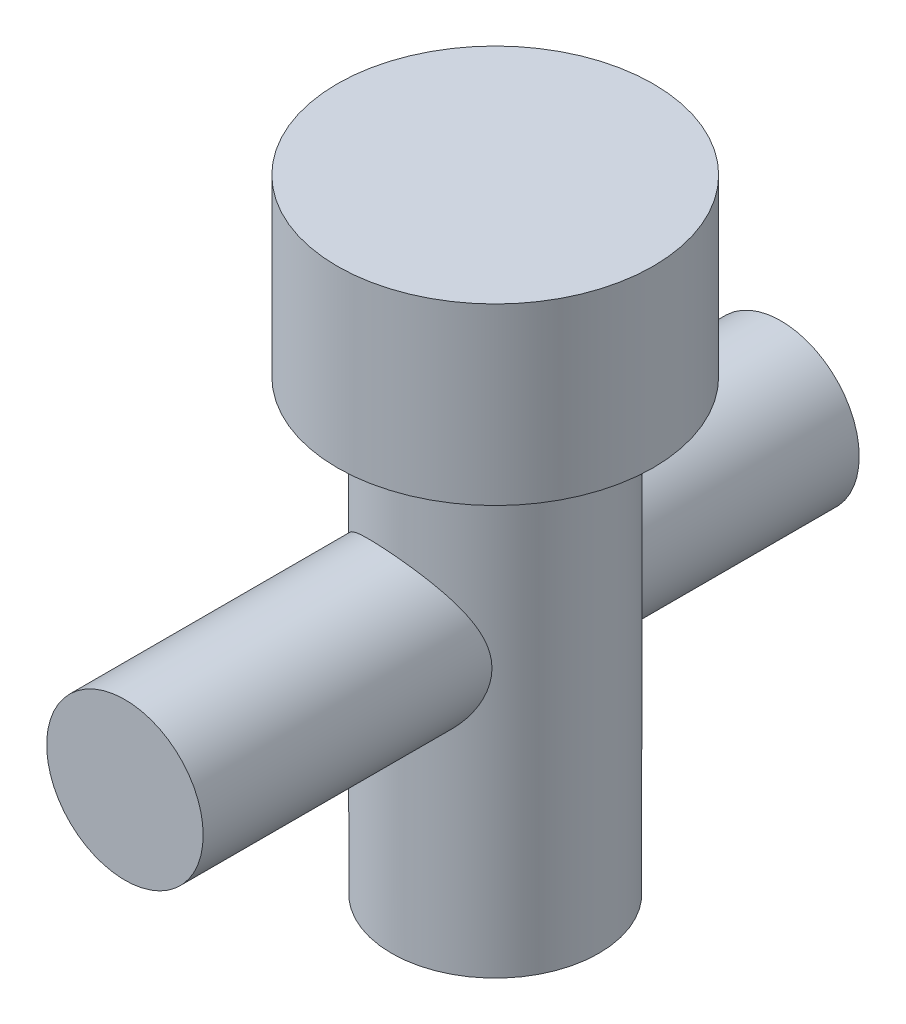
ISO-10303-21;
HEADER;
FILE_DESCRIPTION(('STEP AP214'),'2;1');
FILE_NAME('part.step','',(''),(''),'','','');
FILE_SCHEMA(('AUTOMOTIVE_DESIGN { 1 0 10303 214 1 1 1 1 }'));
ENDSEC;
DATA;
#1=APPLICATION_CONTEXT('core data for automotive mechanical design processes');
#2=APPLICATION_PROTOCOL_DEFINITION('international standard','automotive_design',2000,#1);
#3=PRODUCT_CONTEXT('',#1,'mechanical');
#4=PRODUCT('Part','Part','',(#3));
#5=PRODUCT_RELATED_PRODUCT_CATEGORY('part','',(#4));
#6=PRODUCT_DEFINITION_FORMATION('','',#4);
#7=PRODUCT_DEFINITION_CONTEXT('part definition',#1,'design');
#8=PRODUCT_DEFINITION('design','',#6,#7);
#9=PRODUCT_DEFINITION_SHAPE('','',#8);
#10=(LENGTH_UNIT() NAMED_UNIT(*) SI_UNIT(.MILLI.,.METRE.));
#11=(NAMED_UNIT(*) PLANE_ANGLE_UNIT() SI_UNIT($,.RADIAN.));
#12=(NAMED_UNIT(*) SI_UNIT($,.STERADIAN.) SOLID_ANGLE_UNIT());
#13=UNCERTAINTY_MEASURE_WITH_UNIT(LENGTH_MEASURE(1.E-05),#10,'distance_accuracy_value','');
#14=(GEOMETRIC_REPRESENTATION_CONTEXT(3) GLOBAL_UNCERTAINTY_ASSIGNED_CONTEXT((#13)) GLOBAL_UNIT_ASSIGNED_CONTEXT((#10,
#11,#12)) REPRESENTATION_CONTEXT('',''));
#15=CARTESIAN_POINT('',(0.,0.,0.));
#16=DIRECTION('',(0.,0.,1.));
#17=DIRECTION('',(1.,0.,0.));
#18=AXIS2_PLACEMENT_3D('',#15,#16,#17);
#19=CARTESIAN_POINT('',(-4.3439692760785,14.8945899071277,35.9973134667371));
#20=DIRECTION('',(0.,1.,0.));
#21=DIRECTION('',(0.,0.,1.));
#22=AXIS2_PLACEMENT_3D('',#19,#20,#21);
#23=CYLINDRICAL_SURFACE('',#22,19.4598757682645);
#24=CARTESIAN_POINT('',(-4.3439692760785,14.8945899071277,35.9973134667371));
#25=DIRECTION('',(0.,1.,0.));
#26=DIRECTION('',(0.,0.,1.));
#27=AXIS2_PLACEMENT_3D('',#24,#25,#26);
#28=CIRCLE('',#27,19.4598757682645);
#29=CARTESIAN_POINT('',(-4.3439692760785,14.8945899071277,55.4571892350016));
#30=VERTEX_POINT('',#29);
#31=EDGE_CURVE('E10',#30,#30,#28,.T.);
#32=ORIENTED_EDGE('',*,*,#31,.T.);
#33=EDGE_LOOP('',(#32));
#34=FACE_BOUND('',#33,.T.);
#35=CARTESIAN_POINT('',(-4.3439692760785,36.3945899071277,35.9973134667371));
#36=DIRECTION('',(0.,1.,0.));
#37=DIRECTION('',(0.,0.,1.));
#38=AXIS2_PLACEMENT_3D('',#35,#36,#37);
#39=CIRCLE('',#38,19.4598757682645);
#40=CARTESIAN_POINT('',(-4.3439692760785,36.3945899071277,55.4571892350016));
#41=VERTEX_POINT('',#40);
#42=EDGE_CURVE('E45',#41,#41,#39,.T.);
#43=ORIENTED_EDGE('',*,*,#42,.F.);
#44=EDGE_LOOP('',(#43));
#45=FACE_BOUND('',#44,.T.);
#46=ADVANCED_FACE('F33',(#34,#45),#23,.T.);
#47=CARTESIAN_POINT('',(-4.3439692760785,14.8945899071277,35.9973134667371));
#48=DIRECTION('',(0.,1.,0.));
#49=DIRECTION('',(0.,0.,1.));
#50=AXIS2_PLACEMENT_3D('',#47,#48,#49);
#51=PLANE('',#50);
#52=CARTESIAN_POINT('',(-4.3439692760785,14.8945899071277,35.9973134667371));
#53=DIRECTION('',(0.,1.,0.));
#54=DIRECTION('',(0.,0.,1.));
#55=AXIS2_PLACEMENT_3D('',#52,#53,#54);
#56=CIRCLE('',#55,12.7738991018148);
#57=CARTESIAN_POINT('',(-4.3439692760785,14.8945899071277,48.7712125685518));
#58=VERTEX_POINT('',#57);
#59=EDGE_CURVE('E100',#58,#58,#56,.T.);
#60=ORIENTED_EDGE('',*,*,#59,.T.);
#61=EDGE_LOOP('',(#60));
#62=FACE_BOUND('',#61,.T.);
#63=ORIENTED_EDGE('',*,*,#31,.F.);
#64=EDGE_LOOP('',(#63));
#65=FACE_BOUND('',#64,.T.);
#66=ADVANCED_FACE('F80',(#62,#65),#51,.F.);
#67=CARTESIAN_POINT('',(-4.3439692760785,-54.1054100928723,35.9973134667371));
#68=DIRECTION('',(0.,1.,0.));
#69=DIRECTION('',(0.,0.,1.));
#70=AXIS2_PLACEMENT_3D('',#67,#68,#69);
#71=CYLINDRICAL_SURFACE('',#70,12.7738991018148);
#72=CARTESIAN_POINT('',(-4.3439692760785,-16.8025949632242,48.7712125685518));
#73=CARTESIAN_POINT('',(-4.10546095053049,-16.782512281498,48.7712128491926));
#74=CARTESIAN_POINT('',(-3.86770697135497,-16.7535327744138,48.7645188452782));
#75=CARTESIAN_POINT('',(-3.39562501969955,-16.6780952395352,48.7381556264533));
#76=CARTESIAN_POINT('',(-3.16129854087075,-16.6316298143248,48.7184809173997));
#77=CARTESIAN_POINT('',(-2.69769875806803,-16.5217486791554,48.6668349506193));
#78=CARTESIAN_POINT('',(-2.46843313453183,-16.458308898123,48.6348462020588));
#79=CARTESIAN_POINT('',(-2.0168140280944,-16.3152935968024,48.5595302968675));
#80=CARTESIAN_POINT('',(-1.79446369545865,-16.2357108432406,48.5161980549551));
#81=CARTESIAN_POINT('',(-1.35961531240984,-16.0619660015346,48.4196877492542));
#82=CARTESIAN_POINT('',(-1.14705976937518,-15.9679085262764,48.3665798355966));
#83=CARTESIAN_POINT('',(-0.731154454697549,-15.7657723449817,48.2515652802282));
#84=CARTESIAN_POINT('',(-0.527808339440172,-15.657688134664,48.1896551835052));
#85=CARTESIAN_POINT('',(0.066821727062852,-15.3140167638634,47.9927883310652));
#86=CARTESIAN_POINT('',(0.443226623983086,-15.0587965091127,47.8465722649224));
#87=CARTESIAN_POINT('',(1.18829613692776,-14.474237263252,47.5189836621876));
#88=CARTESIAN_POINT('',(1.55215740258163,-14.1399684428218,47.3355404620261));
#89=CARTESIAN_POINT('',(2.0554228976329,-13.6018509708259,47.0543231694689));
#90=CARTESIAN_POINT('',(2.21628608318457,-13.416072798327,46.9594378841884));
#91=CARTESIAN_POINT('',(2.52336863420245,-13.0327897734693,46.7697176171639));
#92=CARTESIAN_POINT('',(2.66959194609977,-12.8352881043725,46.6748826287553));
#93=CARTESIAN_POINT('',(2.9701892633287,-12.394967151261,46.4717471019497));
#94=CARTESIAN_POINT('',(3.12183556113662,-12.1500934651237,46.3638475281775));
#95=CARTESIAN_POINT('',(3.40372758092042,-11.645399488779,46.1548959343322));
#96=CARTESIAN_POINT('',(3.5339673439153,-11.3855750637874,46.0538458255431));
#97=CARTESIAN_POINT('',(3.77140141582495,-10.8523989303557,45.8632336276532));
#98=CARTESIAN_POINT('',(3.87865457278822,-10.5790840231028,45.7736424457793));
#99=CARTESIAN_POINT('',(4.06881490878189,-10.0195506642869,45.610496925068));
#100=CARTESIAN_POINT('',(4.15173909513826,-9.7333413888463,45.5369313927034));
#101=CARTESIAN_POINT('',(4.26787338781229,-9.24830318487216,45.4319598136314));
#102=CARTESIAN_POINT('',(4.3084230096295,-9.05247163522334,45.3946965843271));
#103=CARTESIAN_POINT('',(4.37744267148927,-8.65701845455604,45.3306783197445));
#104=CARTESIAN_POINT('',(4.40591630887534,-8.45739797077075,45.3039201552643));
#105=CARTESIAN_POINT('',(4.45030952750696,-8.05581839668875,45.2619826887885));
#106=CARTESIAN_POINT('',(4.46624568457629,-7.85386275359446,45.2467880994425));
#107=CARTESIAN_POINT('',(4.48534452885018,-7.44878632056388,45.2285590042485));
#108=CARTESIAN_POINT('',(4.4885068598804,-7.24566549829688,45.2255248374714));
#109=CARTESIAN_POINT('',(4.48199457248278,-6.83966150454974,45.231753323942));
#110=CARTESIAN_POINT('',(4.47230984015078,-6.63677864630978,45.2410256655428));
#111=CARTESIAN_POINT('',(4.44026509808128,-6.23293368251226,45.2714823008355));
#112=CARTESIAN_POINT('',(4.41790518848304,-6.03197156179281,45.2926665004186));
#113=CARTESIAN_POINT('',(4.36085617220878,-5.63307467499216,45.3461119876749));
#114=CARTESIAN_POINT('',(4.32615282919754,-5.43514368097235,45.3783860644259));
#115=CARTESIAN_POINT('',(4.24491519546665,-5.04352888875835,45.4528192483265));
#116=CARTESIAN_POINT('',(4.19837404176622,-4.84984762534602,45.4949840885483));
#117=CARTESIAN_POINT('',(4.07838500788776,-4.41033071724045,45.6017229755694));
#118=CARTESIAN_POINT('',(4.00105352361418,-4.16626159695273,45.6692257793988));
#119=CARTESIAN_POINT('',(3.82855723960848,-3.68795192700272,45.8154128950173));
#120=CARTESIAN_POINT('',(3.73338555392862,-3.45371521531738,45.8941015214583));
#121=CARTESIAN_POINT('',(3.52612301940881,-2.99549905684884,46.0597068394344));
#122=CARTESIAN_POINT('',(3.41400962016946,-2.77153380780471,46.1466344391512));
#123=CARTESIAN_POINT('',(3.17379346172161,-2.33464406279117,46.3258271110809));
#124=CARTESIAN_POINT('',(3.04569187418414,-2.12171875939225,46.418091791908));
#125=CARTESIAN_POINT('',(2.77097577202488,-1.7024496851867,46.6076170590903));
#126=CARTESIAN_POINT('',(2.62400206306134,-1.49637143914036,46.7049438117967));
#127=CARTESIAN_POINT('',(2.31441778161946,-1.09649126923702,46.9001516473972));
#128=CARTESIAN_POINT('',(2.15180274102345,-0.902692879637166,46.9980328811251));
#129=CARTESIAN_POINT('',(1.81151248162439,-0.528156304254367,47.1919938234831));
#130=CARTESIAN_POINT('',(1.63384968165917,-0.347407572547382,47.288074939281));
#131=CARTESIAN_POINT('',(1.26373170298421,0.000455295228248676,47.4763943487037));
#132=CARTESIAN_POINT('',(1.07127676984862,0.167569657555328,47.5686327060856));
#133=CARTESIAN_POINT('',(0.680675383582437,0.480289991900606,47.7433432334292));
#134=CARTESIAN_POINT('',(0.483136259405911,0.626513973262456,47.8260653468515));
#135=CARTESIAN_POINT('',(0.0755414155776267,0.904561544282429,47.9843143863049));
#136=CARTESIAN_POINT('',(-0.134509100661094,1.03639105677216,48.0598442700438));
#137=CARTESIAN_POINT('',(-0.566471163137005,1.28458818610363,48.202013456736));
#138=CARTESIAN_POINT('',(-0.788383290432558,1.40095504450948,48.2686523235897));
#139=CARTESIAN_POINT('',(-1.24303102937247,1.61699222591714,48.3913486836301));
#140=CARTESIAN_POINT('',(-1.47576655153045,1.71666268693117,48.447406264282));
#141=CARTESIAN_POINT('',(-1.95264455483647,1.89881430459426,48.5477680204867));
#142=CARTESIAN_POINT('',(-2.19686523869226,1.98114702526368,48.5919715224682));
#143=CARTESIAN_POINT('',(-2.69310213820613,2.12639256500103,48.6665705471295));
#144=CARTESIAN_POINT('',(-2.94511844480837,2.18930515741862,48.6969659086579));
#145=CARTESIAN_POINT('',(-3.45452242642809,2.29469089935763,48.742772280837));
#146=CARTESIAN_POINT('',(-3.7119054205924,2.33718114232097,48.7581958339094));
#147=CARTESIAN_POINT('',(-4.22971354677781,2.40115309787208,48.7733259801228));
#148=CARTESIAN_POINT('',(-4.4901382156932,2.4226379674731,48.7730349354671));
#149=CARTESIAN_POINT('',(-4.97496959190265,2.44288043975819,48.7575922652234));
#150=CARTESIAN_POINT('',(-5.1993345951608,2.44438960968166,48.7445186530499));
#151=CARTESIAN_POINT('',(-5.64660944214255,2.43184448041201,48.7066006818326));
#152=CARTESIAN_POINT('',(-5.86951944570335,2.41779192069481,48.6817576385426));
#153=CARTESIAN_POINT('',(-6.31225584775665,2.37449814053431,48.6206368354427));
#154=CARTESIAN_POINT('',(-6.53208231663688,2.34525726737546,48.5843593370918));
#155=CARTESIAN_POINT('',(-6.96718915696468,2.27216603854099,48.5009245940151));
#156=CARTESIAN_POINT('',(-7.1824693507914,2.22831511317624,48.4537669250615));
#157=CARTESIAN_POINT('',(-7.60419377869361,2.12745697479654,48.3500430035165));
#158=CARTESIAN_POINT('',(-7.81071987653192,2.07064438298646,48.2936190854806));
#159=CARTESIAN_POINT('',(-8.21717390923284,1.94430610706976,48.1717056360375));
#160=CARTESIAN_POINT('',(-8.41709927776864,1.87477554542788,48.1062126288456));
#161=CARTESIAN_POINT('',(-8.80947526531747,1.72384960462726,47.9670705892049));
#162=CARTESIAN_POINT('',(-9.00192592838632,1.64245429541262,47.893421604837));
#163=CARTESIAN_POINT('',(-9.37878139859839,1.4686175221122,47.7388919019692));
#164=CARTESIAN_POINT('',(-9.56318463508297,1.37617391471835,47.6580097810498));
#165=CARTESIAN_POINT('',(-9.99623135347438,1.14163278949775,47.4560329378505));
#166=CARTESIAN_POINT('',(-10.2407694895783,0.994551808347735,47.3318819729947));
#167=CARTESIAN_POINT('',(-10.7123914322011,0.682099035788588,47.0737760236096));
#168=CARTESIAN_POINT('',(-10.9394691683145,0.516720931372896,46.939817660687));
#169=CARTESIAN_POINT('',(-11.3762352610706,0.168896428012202,46.6643902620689));
#170=CARTESIAN_POINT('',(-11.5858839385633,-0.0135870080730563,46.522905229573));
#171=CARTESIAN_POINT('',(-11.9870334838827,-0.394097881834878,46.2353292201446));
#172=CARTESIAN_POINT('',(-12.1785363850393,-0.592123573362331,46.0892387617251));
#173=CARTESIAN_POINT('',(-12.546101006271,-1.00611514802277,45.7929293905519));
#174=CARTESIAN_POINT('',(-12.7218831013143,-1.22230834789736,45.6426814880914));
#175=CARTESIAN_POINT('',(-13.0545171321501,-1.66969037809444,45.3433769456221));
#176=CARTESIAN_POINT('',(-13.2113645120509,-1.90088279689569,45.1943206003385));
#177=CARTESIAN_POINT('',(-13.5054015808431,-2.37792896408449,44.9014491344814));
#178=CARTESIAN_POINT('',(-13.6426237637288,-2.62375750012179,44.7576256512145));
#179=CARTESIAN_POINT('',(-13.8968313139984,-3.13082701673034,44.4796901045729));
#180=CARTESIAN_POINT('',(-14.0138290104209,-3.39205847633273,44.345572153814));
#181=CARTESIAN_POINT('',(-14.1835411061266,-3.82244315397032,44.1437928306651));
#182=CARTESIAN_POINT('',(-14.243215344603,-3.98649592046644,44.071054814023));
#183=CARTESIAN_POINT('',(-14.3543511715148,-4.32042778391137,43.9328415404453));
#184=CARTESIAN_POINT('',(-14.4058112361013,-4.49030795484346,43.8673676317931));
#185=CARTESIAN_POINT('',(-14.4998531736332,-4.83541128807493,43.7456316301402));
#186=CARTESIAN_POINT('',(-14.5424503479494,-5.01062463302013,43.6893536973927));
#187=CARTESIAN_POINT('',(-14.6182077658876,-5.36615842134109,43.5878694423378));
#188=CARTESIAN_POINT('',(-14.6513737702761,-5.54647567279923,43.5426563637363));
#189=CARTESIAN_POINT('',(-14.7035259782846,-5.88483141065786,43.4708505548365));
#190=CARTESIAN_POINT('',(-14.7238743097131,-6.04228674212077,43.4425044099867));
#191=CARTESIAN_POINT('',(-14.7568387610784,-6.35948265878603,43.3963308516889));
#192=CARTESIAN_POINT('',(-14.7694584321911,-6.51922215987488,43.3784986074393));
#193=CARTESIAN_POINT('',(-14.7867072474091,-6.83990899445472,43.3540755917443));
#194=CARTESIAN_POINT('',(-14.7913408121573,-7.00085561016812,43.3474786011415));
#195=CARTESIAN_POINT('',(-14.7925266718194,-7.3228418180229,43.3457927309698));
#196=CARTESIAN_POINT('',(-14.7890787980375,-7.483881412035,43.3507040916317));
#197=CARTESIAN_POINT('',(-14.7741924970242,-7.80451913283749,43.3718037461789));
#198=CARTESIAN_POINT('',(-14.7627701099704,-7.96411950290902,43.3879694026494));
#199=CARTESIAN_POINT('',(-14.7321996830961,-8.28116582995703,43.4308756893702));
#200=CARTESIAN_POINT('',(-14.7130484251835,-8.43861086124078,43.4576207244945));
#201=CARTESIAN_POINT('',(-14.6444625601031,-8.90667756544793,43.5523433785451));
#202=CARTESIAN_POINT('',(-14.5839043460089,-9.21286000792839,43.634795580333));
#203=CARTESIAN_POINT('',(-14.4529221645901,-9.74278123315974,43.8069516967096));
#204=CARTESIAN_POINT('',(-14.3876483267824,-9.96976835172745,43.8910115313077));
#205=CARTESIAN_POINT('',(-14.2425362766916,-10.4137691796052,44.0722351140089));
#206=CARTESIAN_POINT('',(-14.1626898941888,-10.6307772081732,44.1694062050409));
#207=CARTESIAN_POINT('',(-13.989256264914,-11.0553247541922,44.3734049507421));
#208=CARTESIAN_POINT('',(-13.8956291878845,-11.2628344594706,44.4802602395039));
#209=CARTESIAN_POINT('',(-13.6955507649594,-11.6679884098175,44.7003335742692));
#210=CARTESIAN_POINT('',(-13.5891002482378,-11.8656332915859,44.813551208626));
#211=CARTESIAN_POINT('',(-13.3218037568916,-12.3233299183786,45.0868597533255));
#212=CARTESIAN_POINT('',(-13.1554782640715,-12.57916253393,45.248683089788));
#213=CARTESIAN_POINT('',(-12.8001429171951,-13.0731438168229,45.5745691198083));
#214=CARTESIAN_POINT('',(-12.6111246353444,-13.3112858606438,45.7386326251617));
#215=CARTESIAN_POINT('',(-12.2109244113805,-13.7692221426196,46.064590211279));
#216=CARTESIAN_POINT('',(-11.9997660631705,-13.9890354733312,46.2264863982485));
#217=CARTESIAN_POINT('',(-11.555318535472,-14.4095339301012,46.5445204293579));
#218=CARTESIAN_POINT('',(-11.3220371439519,-14.6102257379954,46.7006602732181));
#219=CARTESIAN_POINT('',(-10.8837378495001,-14.9517840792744,46.9725634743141));
#220=CARTESIAN_POINT('',(-10.6827501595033,-15.0964738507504,47.0900350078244));
#221=CARTESIAN_POINT('',(-10.2672192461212,-15.3716514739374,47.3173693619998));
#222=CARTESIAN_POINT('',(-10.0526787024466,-15.5021421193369,47.427233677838));
#223=CARTESIAN_POINT('',(-9.61069612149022,-15.7475233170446,47.6374992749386));
#224=CARTESIAN_POINT('',(-9.38326556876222,-15.8624274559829,47.7379087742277));
#225=CARTESIAN_POINT('',(-8.91614278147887,-16.0752786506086,47.9275787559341));
#226=CARTESIAN_POINT('',(-8.67645283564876,-16.1732288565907,48.0168413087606));
#227=CARTESIAN_POINT('',(-8.2251258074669,-16.3364666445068,48.1692677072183));
#228=CARTESIAN_POINT('',(-8.01510811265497,-16.4044719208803,48.2343236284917));
#229=CARTESIAN_POINT('',(-7.58824647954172,-16.5264707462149,48.3543475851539));
#230=CARTESIAN_POINT('',(-7.37140383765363,-16.580466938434,48.4093175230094));
#231=CARTESIAN_POINT('',(-6.9324243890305,-16.6735250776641,48.5082261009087));
#232=CARTESIAN_POINT('',(-6.71029637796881,-16.7126102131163,48.5521818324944));
#233=CARTESIAN_POINT('',(-6.26195833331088,-16.7752276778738,48.6284457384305));
#234=CARTESIAN_POINT('',(-6.03574977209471,-16.7987655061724,48.6607580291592));
#235=CARTESIAN_POINT('',(-5.56564079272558,-16.8308081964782,48.7150040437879));
#236=CARTESIAN_POINT('',(-5.32156655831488,-16.8382058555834,48.7361019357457));
#237=CARTESIAN_POINT('',(-4.83272157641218,-16.8343721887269,48.7642069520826));
#238=CARTESIAN_POINT('',(-4.58795074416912,-16.823138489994,48.7712122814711));
#239=CARTESIAN_POINT('',(-4.3439692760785,-16.8025949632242,48.7712125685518));
#240=B_SPLINE_CURVE_WITH_KNOTS('',3,(#72,#73,#74,#75,#76,#77,#78,#79,#80,#81,#82,#83,#84,#85,
#86,#87,#88,#89,#90,#91,#92,#93,#94,#95,#96,#97,#98,#99,#100,#101,#102,#103,#104,#105,#106,#107,
#108,#109,#110,#111,#112,#113,#114,#115,#116,#117,#118,#119,#120,#121,#122,#123,#124,#125,#126,
#127,#128,#129,#130,#131,#132,#133,#134,#135,#136,#137,#138,#139,#140,#141,#142,#143,#144,#145,
#146,#147,#148,#149,#150,#151,#152,#153,#154,#155,#156,#157,#158,#159,#160,#161,#162,#163,#164,
#165,#166,#167,#168,#169,#170,#171,#172,#173,#174,#175,#176,#177,#178,#179,#180,#181,#182,#183,
#184,#185,#186,#187,#188,#189,#190,#191,#192,#193,#194,#195,#196,#197,#198,#199,#200,#201,#202,
#203,#204,#205,#206,#207,#208,#209,#210,#211,#212,#213,#214,#215,#216,#217,#218,#219,#220,#221,
#222,#223,#224,#225,#226,#227,#228,#229,#230,#231,#232,#233,#234,#235,#236,#237,#238,#239),
.UNSPECIFIED.,.T.,.F.,(4,2,2,2,2,2,2,2,2,2,2,2,2,2,2,2,2,2,2,2,2,2,2,2,2,2,2,2,2,2,2,2,2,2,2,2,
2,2,2,2,2,2,2,2,2,2,2,2,2,2,2,2,2,2,2,2,2,2,2,2,2,2,2,2,2,2,2,2,2,2,2,2,2,2,2,2,2,2,2,2,2,2,2,
4),(0.,0.717794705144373,1.43589341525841,2.15501589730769,2.87446131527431,3.58893216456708,
4.30368423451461,5.73145529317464,7.3065012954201,8.09624417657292,8.88577359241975,
9.80736478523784,10.7292120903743,11.6486704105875,12.5674844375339,13.1771808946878,
13.7866956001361,14.3954031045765,15.0041275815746,15.613331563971,16.2225307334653,
16.8324348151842,17.4426932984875,18.2358531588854,19.0293197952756,19.8238520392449,
20.6183260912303,21.4311463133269,22.2441994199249,23.0565879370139,23.868962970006,
24.6461601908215,25.423036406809,26.1999507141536,26.9768585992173,27.7601693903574,
28.5434893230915,29.3261524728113,30.1086979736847,30.7821151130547,31.4554569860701,
32.1287834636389,32.8021361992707,33.4659759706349,34.1300708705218,34.794161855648,
35.4583818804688,36.3906396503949,37.3232200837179,38.2578685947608,39.1924122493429,
40.1411905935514,41.0901967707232,42.037612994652,42.9844496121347,43.551463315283,
44.1185820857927,44.6847134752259,45.250498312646,45.7338238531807,46.216927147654,
46.6997629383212,47.1826088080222,47.6644862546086,48.1465645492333,49.1112299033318,
49.8623864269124,50.6139653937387,51.3677609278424,52.1215077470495,53.1563910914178,
54.1916599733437,55.2258366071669,56.2596505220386,57.0812172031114,57.9026219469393,
58.7233060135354,59.543837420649,60.2335610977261,60.9231545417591,61.6116711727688,
62.2999441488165,63.0341168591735,63.7683830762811),.UNSPECIFIED.);
#241=CARTESIAN_POINT('',(-4.3439692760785,-16.8025949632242,48.7712125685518));
#242=VERTEX_POINT('',#241);
#243=EDGE_CURVE('E37',#242,#242,#240,.T.);
#244=ORIENTED_EDGE('',*,*,#243,.F.);
#245=EDGE_LOOP('',(#244));
#246=FACE_BOUND('',#245,.T.);
#247=CARTESIAN_POINT('',(4.486491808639,-7.19734011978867,26.7671750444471));
#248=CARTESIAN_POINT('',(4.48649894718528,-7.43091263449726,26.7671887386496));
#249=CARTESIAN_POINT('',(4.47798868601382,-7.6644267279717,26.7590194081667));
#250=CARTESIAN_POINT('',(4.44416932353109,-8.12921697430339,26.7268395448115));
#251=CARTESIAN_POINT('',(4.41885491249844,-8.36049239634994,26.7028240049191));
#252=CARTESIAN_POINT('',(4.35192864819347,-8.81902882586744,26.6401806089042));
#253=CARTESIAN_POINT('',(4.310289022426,-9.04628229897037,26.6015278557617));
#254=CARTESIAN_POINT('',(4.21149129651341,-9.49489682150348,26.511479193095));
#255=CARTESIAN_POINT('',(4.15432489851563,-9.71625465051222,26.4600764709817));
#256=CARTESIAN_POINT('',(4.02608846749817,-10.1493446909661,26.3473490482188));
#257=CARTESIAN_POINT('',(3.95518572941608,-10.3611582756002,26.2861451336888));
#258=CARTESIAN_POINT('',(3.79989300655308,-10.7770702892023,26.1555491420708));
#259=CARTESIAN_POINT('',(3.71550415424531,-10.981169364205,26.0861577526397));
#260=CARTESIAN_POINT('',(3.44309544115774,-11.5813361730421,25.8687468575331));
#261=CARTESIAN_POINT('',(3.23576006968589,-11.9655170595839,25.7114228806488));
#262=CARTESIAN_POINT('',(2.8693322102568,-12.5476743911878,25.4536688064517));
#263=CARTESIAN_POINT('',(2.72558640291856,-12.7571240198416,25.356520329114));
#264=CARTESIAN_POINT('',(2.42225483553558,-13.1637971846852,25.1611144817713));
#265=CARTESIAN_POINT('',(2.26266784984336,-13.3610197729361,25.0628570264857));
#266=CARTESIAN_POINT('',(1.92792549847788,-13.7428413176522,24.8674682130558));
#267=CARTESIAN_POINT('',(1.75275166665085,-13.9274248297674,24.7703383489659));
#268=CARTESIAN_POINT('',(1.38738791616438,-14.2829997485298,24.579497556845));
#269=CARTESIAN_POINT('',(1.19719850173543,-14.4539916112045,24.4857865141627));
#270=CARTESIAN_POINT('',(0.775067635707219,-14.8039900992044,24.2913703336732));
#271=CARTESIAN_POINT('',(0.540979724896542,-14.9808708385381,24.191472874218));
#272=CARTESIAN_POINT('',(0.0547386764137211,-15.3142336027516,24.0018157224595));
#273=CARTESIAN_POINT('',(-0.197417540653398,-15.4707121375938,23.9120577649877));
#274=CARTESIAN_POINT('',(-0.717965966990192,-15.7610042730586,23.7458195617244));
#275=CARTESIAN_POINT('',(-0.986326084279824,-15.8948607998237,23.6693141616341));
#276=CARTESIAN_POINT('',(-1.53775439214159,-16.1381189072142,23.5322321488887));
#277=CARTESIAN_POINT('',(-1.82081556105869,-16.2475320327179,23.4716480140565));
#278=CARTESIAN_POINT('',(-2.31718531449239,-16.4126746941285,23.3834701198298));
#279=CARTESIAN_POINT('',(-2.52758470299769,-16.4748357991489,23.3513919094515));
#280=CARTESIAN_POINT('',(-2.9533589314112,-16.5848865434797,23.2975218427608));
#281=CARTESIAN_POINT('',(-3.16873269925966,-16.6327792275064,23.2757277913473));
#282=CARTESIAN_POINT('',(-3.60294354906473,-16.7137412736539,23.243068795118));
#283=CARTESIAN_POINT('',(-3.82177859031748,-16.7468190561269,23.2321976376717));
#284=CARTESIAN_POINT('',(-4.26148880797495,-16.7978444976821,23.2217878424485));
#285=CARTESIAN_POINT('',(-4.48236406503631,-16.8157915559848,23.2222496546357));
#286=CARTESIAN_POINT('',(-4.92473260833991,-16.8364344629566,23.2347030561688));
#287=CARTESIAN_POINT('',(-5.1462262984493,-16.8391144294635,23.2467066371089));
#288=CARTESIAN_POINT('',(-5.58794627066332,-16.8292903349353,23.2821998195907));
#289=CARTESIAN_POINT('',(-5.80817256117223,-16.8167863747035,23.3056893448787));
#290=CARTESIAN_POINT('',(-6.24582919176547,-16.7769297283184,23.363858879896));
#291=CARTESIAN_POINT('',(-6.46325884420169,-16.7495734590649,23.3985415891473));
#292=CARTESIAN_POINT('',(-6.89382908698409,-16.6805491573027,23.4785807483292));
#293=CARTESIAN_POINT('',(-7.10696959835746,-16.6388808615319,23.5239373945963));
#294=CARTESIAN_POINT('',(-7.52699135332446,-16.5420895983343,23.6244662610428));
#295=CARTESIAN_POINT('',(-7.73389134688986,-16.4870126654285,23.6796047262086));
#296=CARTESIAN_POINT('',(-8.14123248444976,-16.364091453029,23.7990200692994));
#297=CARTESIAN_POINT('',(-8.34167108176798,-16.2962422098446,23.8633004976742));
#298=CARTESIAN_POINT('',(-8.7351953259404,-16.1486154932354,24.0001042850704));
#299=CARTESIAN_POINT('',(-8.92828084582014,-16.0688378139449,24.0726277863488));
#300=CARTESIAN_POINT('',(-9.30650238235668,-15.8981727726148,24.2250003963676));
#301=CARTESIAN_POINT('',(-9.49163684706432,-15.8072832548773,24.3048509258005));
#302=CARTESIAN_POINT('',(-9.92548332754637,-15.5769629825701,24.5039850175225));
#303=CARTESIAN_POINT('',(-10.1701962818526,-15.432603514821,24.6263209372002));
#304=CARTESIAN_POINT('',(-10.6424289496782,-15.1256370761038,24.8809325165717));
#305=CARTESIAN_POINT('',(-10.8699427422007,-14.9630238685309,25.0132115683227));
#306=CARTESIAN_POINT('',(-11.3077934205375,-14.6208101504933,25.2854398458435));
#307=CARTESIAN_POINT('',(-11.5180934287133,-14.4411748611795,25.4254045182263));
#308=CARTESIAN_POINT('',(-11.9207798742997,-14.0664394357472,25.7101736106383));
#309=CARTESIAN_POINT('',(-12.113168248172,-13.8713409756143,25.8549775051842));
#310=CARTESIAN_POINT('',(-12.4827432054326,-13.4633770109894,26.1489915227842));
#311=CARTESIAN_POINT('',(-12.6596548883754,-13.2502868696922,26.2982351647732));
#312=CARTESIAN_POINT('',(-12.9948102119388,-12.8092853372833,26.5959475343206));
#313=CARTESIAN_POINT('',(-13.1530497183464,-12.581370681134,26.7444160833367));
#314=CARTESIAN_POINT('',(-13.4502117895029,-12.1110480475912,27.0367214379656));
#315=CARTESIAN_POINT('',(-13.5891622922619,-11.8686617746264,27.1805647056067));
#316=CARTESIAN_POINT('',(-13.8472131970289,-11.3687310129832,27.4593480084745));
#317=CARTESIAN_POINT('',(-13.9663246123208,-11.1111950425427,27.5942929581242));
#318=CARTESIAN_POINT('',(-14.1412355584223,-10.6834541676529,27.7999588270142));
#319=CARTESIAN_POINT('',(-14.2036648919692,-10.5181495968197,27.8752783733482));
#320=CARTESIAN_POINT('',(-14.3201642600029,-10.1815254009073,28.0188070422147));
#321=CARTESIAN_POINT('',(-14.374232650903,-10.0102046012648,28.0870147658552));
#322=CARTESIAN_POINT('',(-14.4733374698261,-9.66198607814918,28.214325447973));
#323=CARTESIAN_POINT('',(-14.5183890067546,-9.48509826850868,28.2734435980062));
#324=CARTESIAN_POINT('',(-14.5988841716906,-9.12593994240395,28.3806396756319));
#325=CARTESIAN_POINT('',(-14.6343337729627,-8.94367285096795,28.4287244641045));
#326=CARTESIAN_POINT('',(-14.690231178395,-8.60322922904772,28.505367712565));
#327=CARTESIAN_POINT('',(-14.7121551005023,-8.44571813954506,28.5358004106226));
#328=CARTESIAN_POINT('',(-14.7482752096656,-8.12821298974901,28.5862484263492));
#329=CARTESIAN_POINT('',(-14.7624750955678,-7.96822015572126,28.6062687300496));
#330=CARTESIAN_POINT('',(-14.7828589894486,-7.64681873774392,28.6350858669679));
#331=CARTESIAN_POINT('',(-14.7890485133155,-7.48541120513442,28.6438904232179));
#332=CARTESIAN_POINT('',(-14.7932894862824,-7.16226729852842,28.6499180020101));
#333=CARTESIAN_POINT('',(-14.7913408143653,-7.00053091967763,28.6471408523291));
#334=CARTESIAN_POINT('',(-14.779356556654,-6.67814548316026,28.630136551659));
#335=CARTESIAN_POINT('',(-14.7693296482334,-6.51749544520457,28.6159216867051));
#336=CARTESIAN_POINT('',(-14.7414198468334,-6.19823209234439,28.5766602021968));
#337=CARTESIAN_POINT('',(-14.7235368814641,-6.0396187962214,28.5516134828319));
#338=CARTESIAN_POINT('',(-14.6802344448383,-5.72513346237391,28.4916166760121));
#339=CARTESIAN_POINT('',(-14.6548055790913,-5.56926509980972,28.4566542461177));
#340=CARTESIAN_POINT('',(-14.5968279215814,-5.26107621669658,28.3780108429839));
#341=CARTESIAN_POINT('',(-14.5642769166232,-5.10875681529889,28.3343271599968));
#342=CARTESIAN_POINT('',(-14.473655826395,-4.72927960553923,28.2146308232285));
#343=CARTESIAN_POINT('',(-14.4111515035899,-4.50473007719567,28.1336723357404));
#344=CARTESIAN_POINT('',(-14.271913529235,-4.06538306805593,27.9585991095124));
#345=CARTESIAN_POINT('',(-14.1951721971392,-3.85059092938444,27.864477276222));
#346=CARTESIAN_POINT('',(-14.028266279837,-3.43016263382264,27.6664248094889));
#347=CARTESIAN_POINT('',(-13.9380630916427,-3.22455509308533,27.562466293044));
#348=CARTESIAN_POINT('',(-13.7451520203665,-2.822941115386,27.34797317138));
#349=CARTESIAN_POINT('',(-13.6424448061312,-2.6269341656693,27.237438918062));
#350=CARTESIAN_POINT('',(-13.3820778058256,-2.16866765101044,26.9677682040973));
#351=CARTESIAN_POINT('',(-13.2187256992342,-1.91078322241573,26.8066637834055));
#352=CARTESIAN_POINT('',(-12.8693121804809,-1.41267582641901,26.4816397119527));
#353=CARTESIAN_POINT('',(-12.6832419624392,-1.17245976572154,26.3177189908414));
#354=CARTESIAN_POINT('',(-12.2889105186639,-0.710237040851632,25.9915232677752));
#355=CARTESIAN_POINT('',(-12.0806693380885,-0.488214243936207,25.8292469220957));
#356=CARTESIAN_POINT('',(-11.6420599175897,-0.0631150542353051,25.5099918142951));
#357=CARTESIAN_POINT('',(-11.4116993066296,0.139967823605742,25.3530112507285));
#358=CARTESIAN_POINT('',(-10.9767455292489,0.487554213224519,25.0780053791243));
#359=CARTESIAN_POINT('',(-10.7760512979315,0.63570481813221,24.9584105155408));
#360=CARTESIAN_POINT('',(-10.3608013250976,0.917723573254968,24.7266998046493));
#361=CARTESIAN_POINT('',(-10.1462482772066,1.05159448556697,24.6145825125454));
#362=CARTESIAN_POINT('',(-9.70397996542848,1.30360625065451,24.3997641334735));
#363=CARTESIAN_POINT('',(-9.47628070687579,1.42176567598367,24.297051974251));
#364=CARTESIAN_POINT('',(-9.00826615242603,1.64103163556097,24.1027352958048));
#365=CARTESIAN_POINT('',(-8.76795300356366,1.74214105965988,24.0111288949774));
#366=CARTESIAN_POINT('',(-8.31630867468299,1.91063155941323,23.8548103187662));
#367=CARTESIAN_POINT('',(-8.10669731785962,1.98082474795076,23.7881519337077));
#368=CARTESIAN_POINT('',(-7.68044861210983,2.10723963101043,23.6648522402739));
#369=CARTESIAN_POINT('',(-7.46381262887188,2.16346402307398,23.608208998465));
#370=CARTESIAN_POINT('',(-7.02475205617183,2.26105449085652,23.5058486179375));
#371=CARTESIAN_POINT('',(-6.80232939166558,2.30242544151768,23.4601278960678));
#372=CARTESIAN_POINT('',(-6.35306441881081,2.36957619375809,23.3803376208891));
#373=CARTESIAN_POINT('',(-6.12622205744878,2.39535580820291,23.3462682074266));
#374=CARTESIAN_POINT('',(-5.66891732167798,2.43081741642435,23.2902180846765));
#375=CARTESIAN_POINT('',(-5.43844452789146,2.44043838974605,23.2682834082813));
#376=CARTESIAN_POINT('',(-4.97654733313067,2.4430613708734,23.2369873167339));
#377=CARTESIAN_POINT('',(-4.74512292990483,2.43606333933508,23.227625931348));
#378=CARTESIAN_POINT('',(-4.2832141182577,2.40539551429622,23.2214706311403));
#379=CARTESIAN_POINT('',(-4.05272972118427,2.38172552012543,23.2246768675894));
#380=CARTESIAN_POINT('',(-3.59456229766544,2.31794164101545,23.243355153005));
#381=CARTESIAN_POINT('',(-3.36687919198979,2.27782822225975,23.2588268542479));
#382=CARTESIAN_POINT('',(-2.92955882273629,2.18452639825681,23.3001774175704));
#383=CARTESIAN_POINT('',(-2.71965772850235,2.13226547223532,23.3253771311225));
#384=CARTESIAN_POINT('',(-2.3050518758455,2.01418119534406,23.3854457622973));
#385=CARTESIAN_POINT('',(-2.10034892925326,1.9483531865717,23.4203180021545));
#386=CARTESIAN_POINT('',(-1.69736182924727,1.80383394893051,23.4989093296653));
#387=CARTESIAN_POINT('',(-1.49907597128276,1.72514617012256,23.5426260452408));
#388=CARTESIAN_POINT('',(-1.1096900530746,1.55559112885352,23.6380198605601));
#389=CARTESIAN_POINT('',(-0.918592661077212,1.46471939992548,23.6896998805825));
#390=CARTESIAN_POINT('',(-0.528503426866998,1.26336534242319,23.8047134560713));
#391=CARTESIAN_POINT('',(-0.330214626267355,1.15187378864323,23.868663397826));
#392=CARTESIAN_POINT('',(0.0563685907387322,0.916312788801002,24.0035042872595));
#393=CARTESIAN_POINT('',(0.244658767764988,0.792238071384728,24.0743981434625));
#394=CARTESIAN_POINT('',(0.610721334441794,0.532331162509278,24.2218098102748));
#395=CARTESIAN_POINT('',(0.788489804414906,0.396494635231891,24.2983296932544));
#396=CARTESIAN_POINT('',(1.13307025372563,0.113825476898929,24.4556317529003));
#397=CARTESIAN_POINT('',(1.29988095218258,-0.0330084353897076,24.5364144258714));
#398=CARTESIAN_POINT('',(1.65129011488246,-0.364447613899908,24.715693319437));
#399=CARTESIAN_POINT('',(1.83367928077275,-0.551092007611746,24.814758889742));
#400=CARTESIAN_POINT('',(2.18236594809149,-0.938033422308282,25.014607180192));
#401=CARTESIAN_POINT('',(2.34866083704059,-1.13833265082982,25.1153901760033));
#402=CARTESIAN_POINT('',(2.66479826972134,-1.55209707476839,25.3162662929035));
#403=CARTESIAN_POINT('',(2.81462958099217,-1.7655711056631,25.4163588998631));
#404=CARTESIAN_POINT('',(3.0971301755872,-2.20507627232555,25.6130873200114));
#405=CARTESIAN_POINT('',(3.22980222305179,-2.43110537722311,25.7097236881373));
#406=CARTESIAN_POINT('',(3.46101841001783,-2.86488048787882,25.8843108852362));
#407=CARTESIAN_POINT('',(3.56175647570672,-3.07113983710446,25.9630506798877));
#408=CARTESIAN_POINT('',(3.7490696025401,-3.49251171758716,26.1135059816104));
#409=CARTESIAN_POINT('',(3.83564423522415,-3.70762451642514,26.1852212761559));
#410=CARTESIAN_POINT('',(3.99363789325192,-4.1456778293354,26.3191154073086));
#411=CARTESIAN_POINT('',(4.06509069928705,-4.36859957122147,26.3813154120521));
#412=CARTESIAN_POINT('',(4.19213611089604,-4.82174455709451,26.4939139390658));
#413=CARTESIAN_POINT('',(4.2477347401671,-5.05196499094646,26.5443169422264));
#414=CARTESIAN_POINT('',(4.35789953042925,-5.59636152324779,26.6454477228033));
#415=CARTESIAN_POINT('',(4.40594488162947,-5.91294456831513,26.6906842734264));
#416=CARTESIAN_POINT('',(4.47023149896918,-6.55217009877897,26.7515342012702));
#417=CARTESIAN_POINT('',(4.48648195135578,-6.87481080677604,26.7671561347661));
#418=CARTESIAN_POINT('',(4.486491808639,-7.19734011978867,26.7671750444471));
#419=B_SPLINE_CURVE_WITH_KNOTS('',3,(#247,#248,#249,#250,#251,#252,#253,#254,#255,#256,#257,
#258,#259,#260,#261,#262,#263,#264,#265,#266,#267,#268,#269,#270,#271,#272,#273,#274,#275,#276,
#277,#278,#279,#280,#281,#282,#283,#284,#285,#286,#287,#288,#289,#290,#291,#292,#293,#294,#295,
#296,#297,#298,#299,#300,#301,#302,#303,#304,#305,#306,#307,#308,#309,#310,#311,#312,#313,#314,
#315,#316,#317,#318,#319,#320,#321,#322,#323,#324,#325,#326,#327,#328,#329,#330,#331,#332,#333,
#334,#335,#336,#337,#338,#339,#340,#341,#342,#343,#344,#345,#346,#347,#348,#349,#350,#351,#352,
#353,#354,#355,#356,#357,#358,#359,#360,#361,#362,#363,#364,#365,#366,#367,#368,#369,#370,#371,
#372,#373,#374,#375,#376,#377,#378,#379,#380,#381,#382,#383,#384,#385,#386,#387,#388,#389,#390,
#391,#392,#393,#394,#395,#396,#397,#398,#399,#400,#401,#402,#403,#404,#405,#406,#407,#408,#409,
#410,#411,#412,#413,#414,#415,#416,#417,#418),.UNSPECIFIED.,.T.,.F.,(4,2,2,2,2,2,2,2,2,2,2,2,2,
2,2,2,2,2,2,2,2,2,2,2,2,2,2,2,2,2,2,2,2,2,2,2,2,2,2,2,2,2,2,2,2,2,2,2,2,2,2,2,2,2,2,2,2,2,2,2,2,
2,2,2,2,2,2,2,2,2,2,2,2,2,2,2,2,2,2,2,2,2,2,2,2,4),(0.,0.700326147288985,1.4008736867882,
2.10261820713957,2.80473849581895,3.49879165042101,4.19278655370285,5.57999378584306,
6.3953457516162,7.21076085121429,8.02715519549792,8.84352213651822,9.77203694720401,
10.7007103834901,11.62760134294,12.554053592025,13.2185341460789,13.8828728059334,
14.546833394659,15.2108203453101,15.8754979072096,16.5401710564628,17.2050046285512,
17.8698504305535,18.5324450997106,19.1952978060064,19.8581619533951,20.5211549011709,
21.4478360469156,22.3748347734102,23.3037701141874,24.2326049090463,25.1755307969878,
26.1186650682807,27.0604187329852,28.0016478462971,28.5775605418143,29.1535863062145,
29.7286386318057,30.3033323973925,30.7885862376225,31.2736074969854,31.7582945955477,
32.2429889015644,32.7271632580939,33.2113420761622,33.6961262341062,34.1810612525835,
34.9201042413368,35.6595470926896,36.4011526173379,37.1427184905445,38.1768923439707,
39.2114683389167,40.2451167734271,41.2784099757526,42.1075881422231,42.9366056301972,
43.764634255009,44.5925223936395,45.2844808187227,45.9763055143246,46.6679029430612,
47.3595086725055,48.0537203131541,48.7479335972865,49.4421552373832,50.136357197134,
50.7889624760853,51.4417921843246,52.0944470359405,52.7473417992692,53.4555567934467,
54.1640697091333,54.8728449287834,55.5817028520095,56.4182629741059,57.254958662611,
58.0922216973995,58.9293496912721,59.6567555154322,60.3841833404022,61.1099685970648,
61.8354777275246,62.8028047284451,63.7698522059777),.UNSPECIFIED.);
#420=CARTESIAN_POINT('',(4.486491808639,-7.19734011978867,26.7671750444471));
#421=VERTEX_POINT('',#420);
#422=EDGE_CURVE('E54',#421,#421,#419,.T.);
#423=ORIENTED_EDGE('',*,*,#422,.F.);
#424=EDGE_LOOP('',(#423));
#425=FACE_BOUND('',#424,.T.);
#426=ORIENTED_EDGE('',*,*,#59,.F.);
#427=EDGE_LOOP('',(#426));
#428=FACE_BOUND('',#427,.T.);
#429=CARTESIAN_POINT('',(-4.3439692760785,-40.2417981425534,35.9973134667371));
#430=DIRECTION('',(0.,1.,0.));
#431=DIRECTION('',(0.,0.,1.));
#432=AXIS2_PLACEMENT_3D('',#429,#430,#431);
#433=CIRCLE('',#432,12.7738991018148);
#434=CARTESIAN_POINT('',(-4.3439692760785,-40.2417981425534,48.7712125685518));
#435=VERTEX_POINT('',#434);
#436=EDGE_CURVE('E50',#435,#435,#433,.T.);
#437=ORIENTED_EDGE('',*,*,#436,.T.);
#438=EDGE_LOOP('',(#437));
#439=FACE_BOUND('',#438,.T.);
#440=ADVANCED_FACE('F59',(#246,#425,#428,#439),#71,.T.);
#441=CARTESIAN_POINT('',(-5.15275363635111,-7.19734011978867,0.));
#442=DIRECTION('',(0.,0.,1.));
#443=DIRECTION('',(1.,0.,0.));
#444=AXIS2_PLACEMENT_3D('',#441,#442,#443);
#445=CYLINDRICAL_SURFACE('',#444,9.6392454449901);
#446=CARTESIAN_POINT('',(-5.15275363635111,-7.19734011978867,0.));
#447=DIRECTION('',(0.,0.,1.));
#448=DIRECTION('',(1.,0.,0.));
#449=AXIS2_PLACEMENT_3D('',#446,#447,#448);
#450=CIRCLE('',#449,9.6392454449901);
#451=CARTESIAN_POINT('',(4.486491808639,-7.19734011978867,0.));
#452=VERTEX_POINT('',#451);
#453=EDGE_CURVE('E58',#452,#452,#450,.T.);
#454=ORIENTED_EDGE('',*,*,#453,.T.);
#455=EDGE_LOOP('',(#454));
#456=FACE_BOUND('',#455,.T.);
#457=ORIENTED_EDGE('',*,*,#422,.T.);
#458=EDGE_LOOP('',(#457));
#459=FACE_BOUND('',#458,.T.);
#460=ADVANCED_FACE('F66',(#456,#459),#445,.T.);
#461=CARTESIAN_POINT('',(-5.15275363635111,-7.19734011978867,80.8));
#462=DIRECTION('',(0.,0.,1.));
#463=DIRECTION('',(1.,0.,0.));
#464=AXIS2_PLACEMENT_3D('',#461,#462,#463);
#465=CIRCLE('',#464,9.6392454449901);
#466=CARTESIAN_POINT('',(4.486491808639,-7.19734011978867,80.8));
#467=VERTEX_POINT('',#466);
#468=EDGE_CURVE('E105',#467,#467,#465,.T.);
#469=ORIENTED_EDGE('',*,*,#468,.F.);
#470=EDGE_LOOP('',(#469));
#471=FACE_BOUND('',#470,.T.);
#472=ORIENTED_EDGE('',*,*,#243,.T.);
#473=EDGE_LOOP('',(#472));
#474=FACE_BOUND('',#473,.T.);
#475=ADVANCED_FACE('F62',(#471,#474),#445,.T.);
#476=CARTESIAN_POINT('',(-46.3973313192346,36.3945899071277,80.8));
#477=DIRECTION('',(0.,0.,1.));
#478=DIRECTION('',(1.,0.,0.));
#479=AXIS2_PLACEMENT_3D('',#476,#477,#478);
#480=PLANE('',#479);
#481=ORIENTED_EDGE('',*,*,#468,.T.);
#482=EDGE_LOOP('',(#481));
#483=FACE_BOUND('',#482,.T.);
#484=ADVANCED_FACE('F65',(#483),#480,.T.);
#485=CARTESIAN_POINT('',(-46.3973313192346,36.3945899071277,0.));
#486=DIRECTION('',(0.,0.,1.));
#487=DIRECTION('',(1.,0.,0.));
#488=AXIS2_PLACEMENT_3D('',#485,#486,#487);
#489=PLANE('',#488);
#490=ORIENTED_EDGE('',*,*,#453,.F.);
#491=EDGE_LOOP('',(#490));
#492=FACE_BOUND('',#491,.T.);
#493=ADVANCED_FACE('F73',(#492),#489,.F.);
#494=CARTESIAN_POINT('',(-46.3973313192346,-40.2417981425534,0.));
#495=DIRECTION('',(0.,-1.,0.));
#496=DIRECTION('',(0.,0.,-1.));
#497=AXIS2_PLACEMENT_3D('',#494,#495,#496);
#498=PLANE('',#497);
#499=ORIENTED_EDGE('',*,*,#436,.F.);
#500=EDGE_LOOP('',(#499));
#501=FACE_BOUND('',#500,.T.);
#502=ADVANCED_FACE('F89',(#501),#498,.T.);
#503=CARTESIAN_POINT('',(45.7817780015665,36.3945899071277,0.));
#504=DIRECTION('',(0.,1.,0.));
#505=DIRECTION('',(0.,0.,1.));
#506=AXIS2_PLACEMENT_3D('',#503,#504,#505);
#507=PLANE('',#506);
#508=ORIENTED_EDGE('',*,*,#42,.T.);
#509=EDGE_LOOP('',(#508));
#510=FACE_BOUND('',#509,.T.);
#511=ADVANCED_FACE('F35',(#510),#507,.T.);
#512=CLOSED_SHELL('',(#46,#66,#440,#460,#475,#484,#493,#502,#511));
#513=MANIFOLD_SOLID_BREP('B2',#512);
#514=ADVANCED_BREP_SHAPE_REPRESENTATION('',(#18,#513),#14);
#515=SHAPE_DEFINITION_REPRESENTATION(#9,#514);
ENDSEC;
END-ISO-10303-21;
